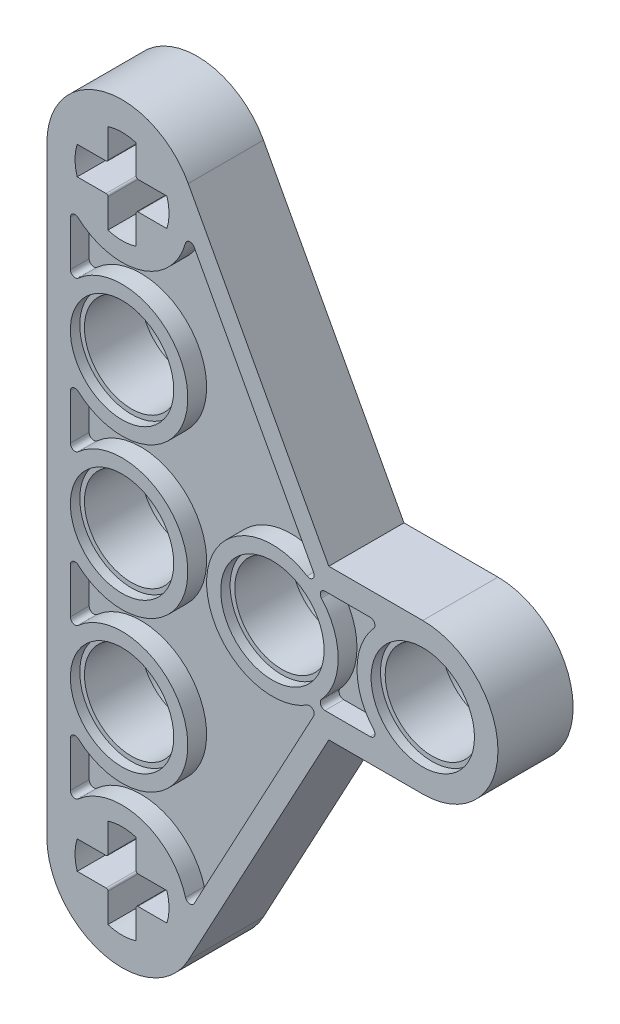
from build123d import *

# Parameters (mm, degrees)
CROQUIS1_R            = 2.5
EXTRUIR1_DEPTH        = 2
CROQUIS2_R            = 2.75
CORTAR_EXTRUIR1_DEPTH = 0.5
CORTAR_EXTRUIR2_DEPTH = 1


with BuildPart() as part:
    # Croquis1 → Extruir1 (new, symmetric)
    with BuildSketch(Plane.XY):
        with BuildLine():
            Line((-5, 4), (0, 4))
            ThreePointArc((0, 4), (4, 0), (0, -4))
            Line((0, -4), (-5, -4))
            Line((-5, -4), (-12.477633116, -17.895502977))
            ThreePointArc((-12.477633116, -17.895502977), (-16.977377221, -19.878754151), (-20, -16))
            Line((-20, -16), (-20, 16))
            ThreePointArc((-20, 16), (-16.977377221, 19.878754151), (-12.477633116, 17.895502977))
            Line((-12.477633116, 17.895502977), (-5, 4))
        make_face()
        with Locations((-16, 8)):
            Circle(CROQUIS1_R, mode=Mode.SUBTRACT)
        with Locations(Location((-16, 0, 0), (0, 0, 180))):
            Circle(CROQUIS1_R, mode=Mode.SUBTRACT)
        with Locations((-8, 0)):
            Circle(CROQUIS1_R, mode=Mode.SUBTRACT)
        Circle(CROQUIS1_R, mode=Mode.SUBTRACT)
        with Locations(Location((-16, -8, 0), (0, 0, 180))):
            Circle(CROQUIS1_R, mode=Mode.SUBTRACT)
        with BuildLine():
            Line((-18.384848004, 16.75), (-16.85, 16.75))
            ThreePointArc((-16.85, 16.75), (-16.779289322, 16.779289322), (-16.75, 16.85))
            Line((-16.75, 16.85), (-16.75, 18.384848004))
            ThreePointArc((-16.75, 18.384848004), (-16, 18.5), (-15.25, 18.384848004))
            Line((-15.25, 18.384848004), (-15.25, 16.85))
            ThreePointArc((-15.25, 16.85), (-15.220710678, 16.779289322), (-15.15, 16.75))
            Line((-15.15, 16.75), (-13.615151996, 16.75))
            ThreePointArc((-13.615151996, 16.75), (-13.5, 16), (-13.615151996, 15.25))
            Line((-13.615151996, 15.25), (-15.15, 15.25))
            ThreePointArc((-15.15, 15.25), (-15.220710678, 15.220710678), (-15.25, 15.15))
            Line((-15.25, 15.15), (-15.25, 13.615151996))
            ThreePointArc((-15.25, 13.615151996), (-16, 13.5), (-16.75, 13.615151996))
            Line((-16.75, 13.615151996), (-16.75, 15.15))
            ThreePointArc((-16.75, 15.15), (-16.779289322, 15.220710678), (-16.85, 15.25))
            Line((-16.85, 15.25), (-18.384848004, 15.25))
            ThreePointArc((-18.384848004, 15.25), (-18.5, 16), (-18.384848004, 16.75))
        make_face(mode=Mode.SUBTRACT)
        with BuildLine():
            Line((-15.25, -16.85), (-15.25, -18.384848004))
            ThreePointArc((-15.25, -18.384848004), (-16, -18.5), (-16.75, -18.384848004))
            Line((-16.75, -18.384848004), (-16.75, -16.85))
            ThreePointArc((-16.75, -16.85), (-16.779289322, -16.779289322), (-16.85, -16.75))
            Line((-16.85, -16.75), (-18.384848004, -16.75))
            ThreePointArc((-18.384848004, -16.75), (-18.5, -16), (-18.384848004, -15.25))
            Line((-18.384848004, -15.25), (-16.85, -15.25))
            ThreePointArc((-16.85, -15.25), (-16.779289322, -15.220710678), (-16.75, -15.15))
            Line((-16.75, -15.15), (-16.75, -13.615151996))
            ThreePointArc((-16.75, -13.615151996), (-16, -13.5), (-15.25, -13.615151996))
            Line((-15.25, -13.615151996), (-15.25, -15.15))
            ThreePointArc((-15.25, -15.15), (-15.220710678, -15.220710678), (-15.15, -15.25))
            Line((-15.15, -15.25), (-13.615151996, -15.25))
            ThreePointArc((-13.615151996, -15.25), (-13.5, -16), (-13.615151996, -16.75))
            Line((-13.615151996, -16.75), (-15.15, -16.75))
            ThreePointArc((-15.15, -16.75), (-15.220710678, -16.779289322), (-15.25, -16.85))
        make_face(mode=Mode.SUBTRACT)
    extrude(amount=EXTRUIR1_DEPTH, both=True)

    # Croquis2 → Cortar-Extruir1 (cut)
    with BuildSketch(Plane.XY.offset(2)):
        with Locations((-16, 0)):
            Circle(CROQUIS2_R)
        with Locations((-8, 0)):
            Circle(CROQUIS2_R)
        Circle(CROQUIS2_R)
        with Locations((-16, 8)):
            Circle(CROQUIS2_R)
        with Locations((-16, -8)):
            Circle(CROQUIS2_R)
    cortar_extruir1 = extrude(amount=-CORTAR_EXTRUIR1_DEPTH, mode=Mode.SUBTRACT)

    # Croquis3 → Cortar-Extruir2 (cut)
    with BuildSketch(Plane.XY.offset(2)):
        with BuildLine():
            Line((-12.164121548, 15.123987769), (-5.804469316, 3.306001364))
            ThreePointArc((-5.804469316, 3.306001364), (-5.853323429, 3.005437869), (-6.15630943, 2.975030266))
            ThreePointArc((-6.15630943, 2.975030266), (-11.5, 0), (-6.15630943, -2.975030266))
            ThreePointArc((-6.15630943, -2.975030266), (-5.853323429, -3.005437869), (-5.804469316, -3.306001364))
            Line((-5.804469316, -3.306001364), (-12.164121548, -15.123987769))
            ThreePointArc((-12.164121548, -15.123987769), (-12.412370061, -15.253934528), (-12.625318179, -15.071817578))
            ThreePointArc((-12.625318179, -15.071817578), (-15.01147831, -12.642497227), (-18.333333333, -13.391254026))
            ThreePointArc((-18.333333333, -13.391254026), (-18.602062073, -13.43313276), (-18.75, -13.204915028))
            Line((-18.75, -13.204915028), (-18.75, -10.795084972))
            ThreePointArc((-18.75, -10.795084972), (-18.602062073, -10.56686724), (-18.333333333, -10.608745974))
            ThreePointArc((-18.333333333, -10.608745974), (-13.604020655, -10.551329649), (-13.25, -5.834936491))
            ThreePointArc((-13.25, -5.834936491), (-15.695670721, -4.513256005), (-18.333333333, -5.391254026))
            ThreePointArc((-18.333333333, -5.391254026), (-18.602062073, -5.43313276), (-18.75, -5.204915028))
            Line((-18.75, -5.204915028), (-18.75, -2.795084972))
            ThreePointArc((-18.75, -2.795084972), (-18.602062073, -2.56686724), (-18.333333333, -2.608745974))
            ThreePointArc((-18.333333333, -2.608745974), (-12.5, 0), (-18.333333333, 2.608745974))
            ThreePointArc((-18.333333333, 2.608745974), (-18.602062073, 2.56686724), (-18.75, 2.795084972))
            Line((-18.75, 2.795084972), (-18.75, 5.204915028))
            ThreePointArc((-18.75, 5.204915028), (-18.602062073, 5.43313276), (-18.333333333, 5.391254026))
            ThreePointArc((-18.333333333, 5.391254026), (-15.695670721, 4.513256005), (-13.25, 5.834936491))
            ThreePointArc((-13.25, 5.834936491), (-13.604020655, 10.551329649), (-18.333333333, 10.608745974))
            ThreePointArc((-18.333333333, 10.608745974), (-18.602062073, 10.56686724), (-18.75, 10.795084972))
            Line((-18.75, 10.795084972), (-18.75, 13.204915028))
            ThreePointArc((-18.75, 13.204915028), (-18.602062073, 13.43313276), (-18.333333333, 13.391254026))
            ThreePointArc((-18.333333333, 13.391254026), (-15.01147831, 12.642497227), (-12.625318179, 15.071817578))
            ThreePointArc((-12.625318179, 15.071817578), (-12.412370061, 15.253934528), (-12.164121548, 15.123987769))
        make_face()
        with BuildLine():
            Line((-5.204915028, 2.75), (-2.795084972, 2.75))
            ThreePointArc((-2.795084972, 2.75), (-2.56686724, 2.602062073), (-2.608745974, 2.333333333))
            ThreePointArc((-2.608745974, 2.333333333), (-3.5, 0), (-2.608745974, -2.333333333))
            ThreePointArc((-2.608745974, -2.333333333), (-2.56686724, -2.602062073), (-2.795084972, -2.75))
            Line((-2.795084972, -2.75), (-5.204915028, -2.75))
            ThreePointArc((-5.204915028, -2.75), (-5.43313276, -2.602062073), (-5.391254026, -2.333333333))
            ThreePointArc((-5.391254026, -2.333333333), (-4.5, 0), (-5.391254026, 2.333333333))
            ThreePointArc((-5.391254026, 2.333333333), (-5.43313276, 2.602062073), (-5.204915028, 2.75))
        make_face()
    cortar_extruir2 = extrude(amount=-CORTAR_EXTRUIR2_DEPTH, mode=Mode.SUBTRACT)

    # Simetr_a1: Cortar-Extruir2 across plane
    add(cortar_extruir2.mirror(Plane.XY), mode=Mode.SUBTRACT)

    # Simetr_a2: Cortar-Extruir1 across plane
    add(cortar_extruir1.mirror(Plane.XY), mode=Mode.SUBTRACT)


solid = part.part
